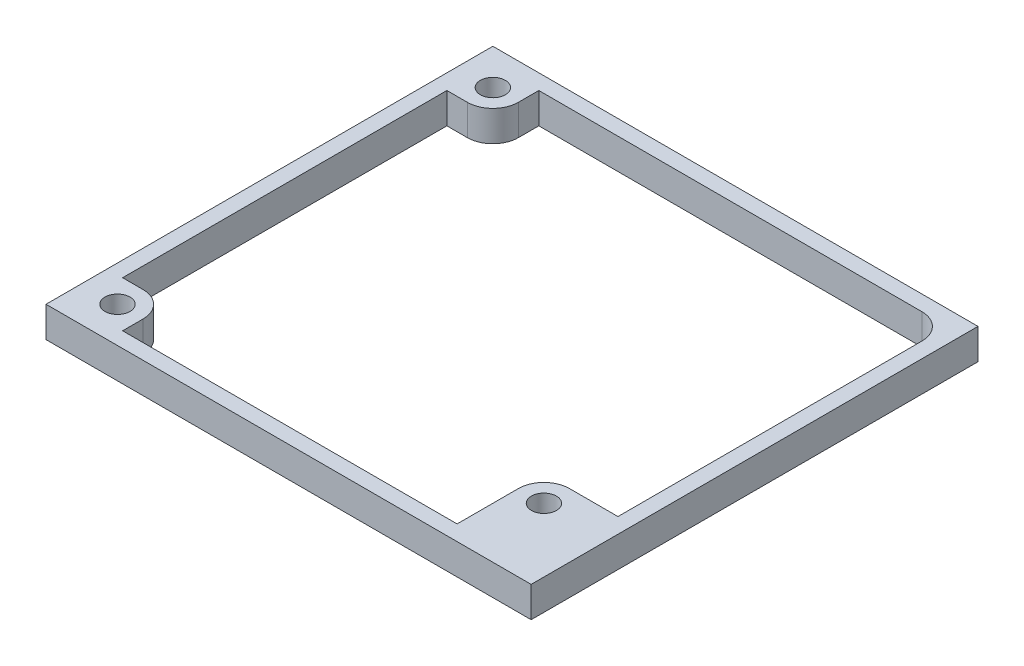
from build123d import *

# Parameters (mm, degrees)
SKETCH1_W           = 48.26
SKETCH1_H           = 44.45
SKETCH1_R           = 1.2446
BOSS_EXTRUDE2_DEPTH = 3.048
FILLET1_R           = 2.54


with BuildPart() as part:
    # Sketch1 → Boss-Extrude2 (new body)
    with BuildSketch(Plane(origin=(0, 0, 0), x_dir=(1, 0, 0), z_dir=(0, 1, 0))):
        with Locations((25.908, 19.304)):
            Rectangle(SKETCH1_W, SKETCH1_H)
        with Locations(Location((5.334, 0.635, 0), (0, 0, 90))):
            Circle(SKETCH1_R, mode=Mode.SUBTRACT)
        with Locations(Location((5.334, 37.973, 0), (0, 0, 90))):
            Circle(SKETCH1_R, mode=Mode.SUBTRACT)
        with Locations(Location((43.688, 4.699, 0), (0, 0, 90))):
            Circle(SKETCH1_R, mode=Mode.SUBTRACT)
        with BuildLine():
            Line((48.514, 7.239), (48.514, 40.005))
            Line((48.514, 40.005), (7.874, 40.005))
            Line((7.874, 40.005), (7.874, 37.973))
            ThreePointArc((7.874, 37.973), (7.130051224, 36.176948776), (5.334, 35.433))
            Line((5.334, 35.433), (3.302, 35.433))
            Line((3.302, 35.433), (3.302, 3.175))
            Line((3.302, 3.175), (5.334, 3.175))
            ThreePointArc((5.334, 3.175), (7.130051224, 2.431051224), (7.874, 0.635))
            Line((7.874, 0.635), (7.874, -1.397))
            Line((7.874, -1.397), (41.148, -1.397))
            Line((41.148, -1.397), (41.148, 4.699))
            ThreePointArc((41.148, 4.699), (41.891948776, 6.495051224), (43.688, 7.239))
            Line((43.688, 7.239), (48.514, 7.239))
        make_face(mode=Mode.SUBTRACT)
    extrude(amount=BOSS_EXTRUDE2_DEPTH)

    # Fillet1
    fillet1_edges = [part.edges().sort_by_distance(p)[0] for p in [
        (48.514, 1.524, -40.005),
    ]]
    fillet(fillet1_edges, radius=FILLET1_R)


solid = part.part
